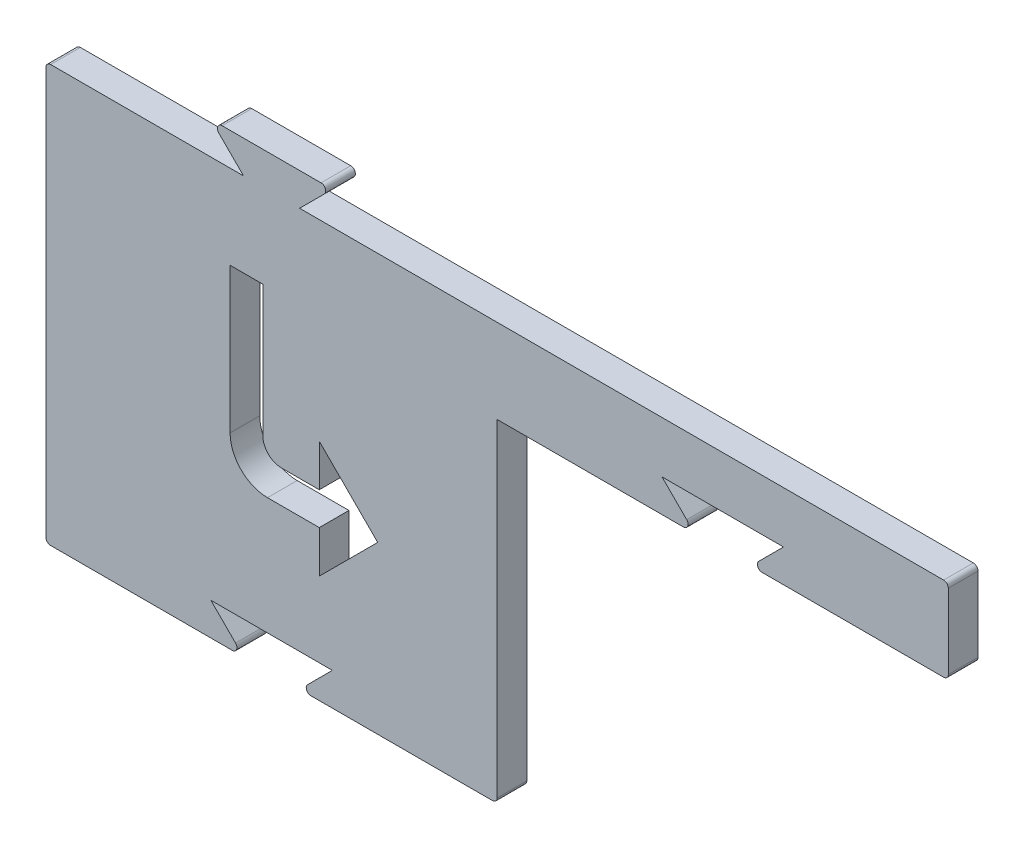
from build123d import *

# Parameters (mm, degrees)
BOSS_EXTRUDE1_DEPTH = 3.175
CUT_EXTRUDE2_DEPTH  = 108.870082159
FILLET1_R           = 2
FILLET2_R           = 4
FILLET3_R           = 0.5


with BuildPart() as part:
    # Sketch1 → Boss-Extrude1 (new body)
    with BuildSketch(Plane.XY):
        Polygon((48.26, 35.56), (48.26, 0), (27.13, 0), (30.63, 3.5), (17.63, 3.5), (21.13, 0), (0, 0), (0, 35.56), (0, 44.56), (21.13, 44.56), (17.63, 48.06), (30.63, 48.06), (27.13, 44.56), (96.52, 44.56), (96.52, 35.56), (75.39, 35.56), (78.89, 39.06), (65.89, 39.06), (69.39, 35.56), align=None)
    extrude(amount=BOSS_EXTRUDE1_DEPTH)

    # Sketch4 → Cut-Extrude2 (cut, through all)
    with BuildSketch(Plane.XY.offset(3.175)):
        Polygon((23.192581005, 35.56), (23.192581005, 19.53), (29.231483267, 19.53), (29.231483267, 24.03), (35.481483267, 17.78), (29.231483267, 11.53), (29.231483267, 16.03), (19.692581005, 16.03), (19.692581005, 35.56), align=None)
    extrude(amount=-CUT_EXTRUDE2_DEPTH, mode=Mode.SUBTRACT)

    # Fillet1
    fillet1_edges = [part.edges().sort_by_distance(p)[0] for p in [
        (23.192581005, 19.53, 1.5875),
    ]]
    fillet(fillet1_edges, radius=FILLET1_R)

    # Fillet2
    fillet2_edges = [part.edges().sort_by_distance(p)[0] for p in [
        (19.692581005, 16.03, 1.5875),
    ]]
    fillet(fillet2_edges, radius=FILLET2_R)

    # Fillet3
    fillet3_edges = [part.edges().sort_by_distance(p)[0] for p in [
        (0, 44.56, 1.5875),
        (17.63, 48.06, 1.5875),
        (30.63, 48.06, 1.5875),
        (96.52, 44.56, 1.5875),
        (96.52, 35.56, 1.5875),
        (75.39, 35.56, 1.5875),
        (69.39, 35.56, 1.5875),
        (48.26, 0, 1.5875),
        (27.13, 0, 1.5875),
        (21.13, 0, 1.5875),
        (0, 0, 1.5875),
    ]]
    fillet(fillet3_edges, radius=FILLET3_R)


solid = part.part
